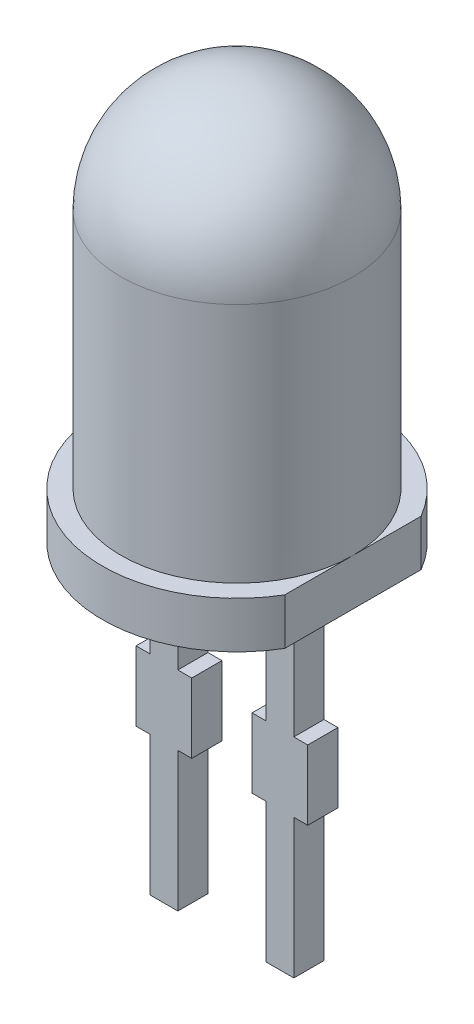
from build123d import *

# Parameters (mm, degrees)
CUT_EXTRUDE_START   = -1
CUT_EXTRUDE_2_DEPTH = 1
EXTRUDE_1_DEPTH     = 0.325
FILLET_1_R          = 0.5


with BuildPart() as part:
    # Sketch 1 → Revolve 1 (revolve)
    with BuildSketch(Plane.XY, mode=Mode.PRIVATE) as revolve_1_sk:
        with BuildLine():
            Line((2.5, 10.4), (2.5, 5.2))
            Line((2.5, 5.2), (2.9, 5.2))
            Line((2.9, 5.2), (2.9, 4.2))
            Line((2.9, 4.2), (0, 4.2))
            Line((0, 4.2), (0, 12.9))
            ThreePointArc((0, 12.9), (1.767766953, 12.167766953), (2.5, 10.4))
        make_face()
    revolve(revolve_1_sk.sketch.rotate(Axis((0, 4.2, 0), (0, 1, 0)), 90), axis=Axis((0, 4.2, 0), (0, 1, 0)))

    # Sketch 3 → Cut-Extrude 2 (cut)
    with BuildSketch(Plane(origin=(0, 5.2, 0), x_dir=(1, 0, 0), z_dir=(0, 1, 0)).offset(CUT_EXTRUDE_START)):
        with BuildLine():
            Line((2.5, 1.469693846), (2.5, -1.469693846))
            ThreePointArc((2.5, -1.469693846), (2.9, 0), (2.5, 1.469693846))
        make_face()
    extrude(amount=CUT_EXTRUDE_2_DEPTH, mode=Mode.SUBTRACT)

    # Sketch 2 → Extrude 1 (add, symmetric)
    with BuildSketch(Plane.XY):
        Polygon((-1.55, 4.2), (-1.55, 1.5), (-1.85, 1.5), (-1.85, 0), (-1.55, 0), (-1.55, -3), (-0.95, -3), (-0.95, 0), (-0.65, 0), (-0.65, 1.5), (-0.95, 1.5), (-0.95, 4.2), align=None)
        Polygon((0.95, 4.2), (0.95, 1.5), (0.65, 1.5), (0.65, 0), (0.95, 0), (0.95, -3), (1.55, -3), (1.55, 0), (1.85, 0), (1.85, 1.5), (1.55, 1.5), (1.55, 4.2), align=None)
    extrude(amount=EXTRUDE_1_DEPTH, both=True)

    # Fillet 1
    fillet_1_edges = [part.edges().sort_by_distance(p)[0] for p in [
        (-1.25, 4.2, -0.325),
        (-0.95, 4.2, 0),
        (-1.55, 4.2, 0),
        (-1.25, 4.2, 0.325),
        (1.25, 4.2, -0.325),
        (1.55, 4.2, 0),
        (0.95, 4.2, 0),
        (1.25, 4.2, 0.325),
    ]]
    fillet(fillet_1_edges, radius=FILLET_1_R)


solid = part.part
